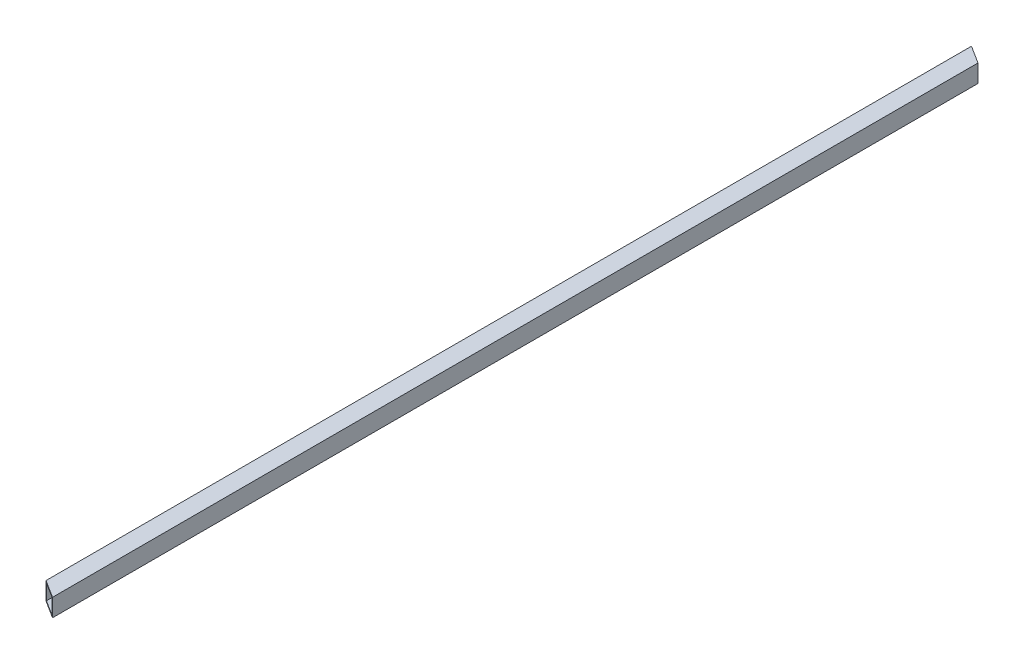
ISO-10303-21;
HEADER;
FILE_DESCRIPTION(('STEP AP214'),'2;1');
FILE_NAME('part.step','',(''),(''),'','','');
FILE_SCHEMA(('AUTOMOTIVE_DESIGN { 1 0 10303 214 1 1 1 1 }'));
ENDSEC;
DATA;
#1=APPLICATION_CONTEXT('core data for automotive mechanical design processes');
#2=APPLICATION_PROTOCOL_DEFINITION('international standard','automotive_design',2000,#1);
#3=PRODUCT_CONTEXT('',#1,'mechanical');
#4=PRODUCT('Part','Part','',(#3));
#5=PRODUCT_RELATED_PRODUCT_CATEGORY('part','',(#4));
#6=PRODUCT_DEFINITION_FORMATION('','',#4);
#7=PRODUCT_DEFINITION_CONTEXT('part definition',#1,'design');
#8=PRODUCT_DEFINITION('design','',#6,#7);
#9=PRODUCT_DEFINITION_SHAPE('','',#8);
#10=(LENGTH_UNIT() NAMED_UNIT(*) SI_UNIT(.MILLI.,.METRE.));
#11=(NAMED_UNIT(*) PLANE_ANGLE_UNIT() SI_UNIT($,.RADIAN.));
#12=(NAMED_UNIT(*) SI_UNIT($,.STERADIAN.) SOLID_ANGLE_UNIT());
#13=UNCERTAINTY_MEASURE_WITH_UNIT(LENGTH_MEASURE(1.E-05),#10,'distance_accuracy_value','');
#14=(GEOMETRIC_REPRESENTATION_CONTEXT(3) GLOBAL_UNCERTAINTY_ASSIGNED_CONTEXT((#13)) GLOBAL_UNIT_ASSIGNED_CONTEXT((#10,
#11,#12)) REPRESENTATION_CONTEXT('',''));
#15=CARTESIAN_POINT('',(0.,0.,0.));
#16=DIRECTION('',(0.,0.,1.));
#17=DIRECTION('',(1.,0.,0.));
#18=AXIS2_PLACEMENT_3D('',#15,#16,#17);
#19=CARTESIAN_POINT('',(0.,0.,2677.0203));
#20=DIRECTION('',(1.,0.,0.));
#21=DIRECTION('',(0.,0.,-1.));
#22=AXIS2_PLACEMENT_3D('',#19,#20,#21);
#23=PLANE('',#22);
#24=DIRECTION('',(0.,0.,-1.));
#25=VECTOR('',#24,1.);
#26=CARTESIAN_POINT('',(0.,0.,2677.0203));
#27=LINE('',#26,#25);
#28=CARTESIAN_POINT('',(0.,0.,2644.91259544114));
#29=VERTEX_POINT('',#28);
#30=CARTESIAN_POINT('',(0.,0.,0.));
#31=VERTEX_POINT('',#30);
#32=EDGE_CURVE('E114',#29,#31,#27,.T.);
#33=ORIENTED_EDGE('',*,*,#32,.F.);
#34=DIRECTION('',(0.,1.,0.));
#35=VECTOR('',#34,1.);
#36=CARTESIAN_POINT('',(0.,0.,2644.91259544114));
#37=LINE('',#36,#35);
#38=CARTESIAN_POINT('',(0.,50.8,2644.91259544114));
#39=VERTEX_POINT('',#38);
#40=EDGE_CURVE('E101',#29,#39,#37,.T.);
#41=ORIENTED_EDGE('',*,*,#40,.T.);
#42=DIRECTION('',(0.,0.,-1.));
#43=VECTOR('',#42,1.);
#44=CARTESIAN_POINT('',(0.,50.8,2677.0203));
#45=LINE('',#44,#43);
#46=CARTESIAN_POINT('',(0.,50.8,0.));
#47=VERTEX_POINT('',#46);
#48=EDGE_CURVE('E120',#39,#47,#45,.T.);
#49=ORIENTED_EDGE('',*,*,#48,.T.);
#50=DIRECTION('',(0.,-1.,0.));
#51=VECTOR('',#50,1.);
#52=CARTESIAN_POINT('',(0.,0.,0.));
#53=LINE('',#52,#51);
#54=EDGE_CURVE('E121',#47,#31,#53,.T.);
#55=ORIENTED_EDGE('',*,*,#54,.T.);
#56=EDGE_LOOP('',(#33,#41,#49,#55));
#57=FACE_BOUND('',#56,.T.);
#58=ADVANCED_FACE('F30',(#57),#23,.F.);
#59=CARTESIAN_POINT('',(0.,0.,2677.0203));
#60=DIRECTION('',(0.,1.,0.));
#61=DIRECTION('',(0.,0.,1.));
#62=AXIS2_PLACEMENT_3D('',#59,#60,#61);
#63=PLANE('',#62);
#64=DIRECTION('',(0.,0.,-1.));
#65=VECTOR('',#64,1.);
#66=CARTESIAN_POINT('',(50.8,0.,2677.0203));
#67=LINE('',#66,#65);
#68=CARTESIAN_POINT('',(50.8,0.,2677.0203));
#69=VERTEX_POINT('',#68);
#70=CARTESIAN_POINT('',(50.8000000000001,0.,32.1077045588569));
#71=VERTEX_POINT('',#70);
#72=EDGE_CURVE('E108',#69,#71,#67,.T.);
#73=ORIENTED_EDGE('',*,*,#72,.F.);
#74=DIRECTION('',(0.845312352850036,0.,0.534272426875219));
#75=VECTOR('',#74,1.);
#76=CARTESIAN_POINT('',(50.8,0.,2677.0203));
#77=LINE('',#76,#75);
#78=EDGE_CURVE('E94',#29,#69,#77,.T.);
#79=ORIENTED_EDGE('',*,*,#78,.F.);
#80=ORIENTED_EDGE('',*,*,#32,.T.);
#81=DIRECTION('',(-0.845312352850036,0.,-0.534272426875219));
#82=VECTOR('',#81,1.);
#83=CARTESIAN_POINT('',(0.,0.,0.));
#84=LINE('',#83,#82);
#85=EDGE_CURVE('E111',#71,#31,#84,.T.);
#86=ORIENTED_EDGE('',*,*,#85,.F.);
#87=EDGE_LOOP('',(#73,#79,#80,#86));
#88=FACE_BOUND('',#87,.T.);
#89=ADVANCED_FACE('F109',(#88),#63,.F.);
#90=CARTESIAN_POINT('',(50.8,0.,2677.0203));
#91=DIRECTION('',(-1.,0.,0.));
#92=DIRECTION('',(0.,-1.,0.));
#93=AXIS2_PLACEMENT_3D('',#90,#91,#92);
#94=PLANE('',#93);
#95=ORIENTED_EDGE('',*,*,#72,.T.);
#96=DIRECTION('',(0.,1.,0.));
#97=VECTOR('',#96,1.);
#98=CARTESIAN_POINT('',(50.8,-9.13362962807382E-13,32.1077045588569));
#99=LINE('',#98,#97);
#100=CARTESIAN_POINT('',(50.7999999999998,50.8,32.1077045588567));
#101=VERTEX_POINT('',#100);
#102=EDGE_CURVE('E148',#71,#101,#99,.T.);
#103=ORIENTED_EDGE('',*,*,#102,.T.);
#104=DIRECTION('',(0.,0.,-1.));
#105=VECTOR('',#104,1.);
#106=CARTESIAN_POINT('',(50.8,50.8,2677.0203));
#107=LINE('',#106,#105);
#108=CARTESIAN_POINT('',(50.8,50.8,2677.0203));
#109=VERTEX_POINT('',#108);
#110=EDGE_CURVE('E115',#109,#101,#107,.T.);
#111=ORIENTED_EDGE('',*,*,#110,.F.);
#112=DIRECTION('',(0.,1.,0.));
#113=VECTOR('',#112,1.);
#114=CARTESIAN_POINT('',(50.8,0.,2677.0203));
#115=LINE('',#114,#113);
#116=EDGE_CURVE('E98',#69,#109,#115,.T.);
#117=ORIENTED_EDGE('',*,*,#116,.F.);
#118=EDGE_LOOP('',(#95,#103,#111,#117));
#119=FACE_BOUND('',#118,.T.);
#120=ADVANCED_FACE('F118',(#119),#94,.F.);
#121=CARTESIAN_POINT('',(0.,50.8,2677.0203));
#122=DIRECTION('',(0.,-1.,0.));
#123=DIRECTION('',(0.,0.,-1.));
#124=AXIS2_PLACEMENT_3D('',#121,#122,#123);
#125=PLANE('',#124);
#126=ORIENTED_EDGE('',*,*,#48,.F.);
#127=DIRECTION('',(0.845312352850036,0.,0.534272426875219));
#128=VECTOR('',#127,1.);
#129=CARTESIAN_POINT('',(50.8,50.8,2677.0203));
#130=LINE('',#129,#128);
#131=EDGE_CURVE('E104',#39,#109,#130,.T.);
#132=ORIENTED_EDGE('',*,*,#131,.T.);
#133=ORIENTED_EDGE('',*,*,#110,.T.);
#134=DIRECTION('',(-0.845312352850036,0.,-0.534272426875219));
#135=VECTOR('',#134,1.);
#136=CARTESIAN_POINT('',(0.,50.8,0.));
#137=LINE('',#136,#135);
#138=EDGE_CURVE('E163',#101,#47,#137,.T.);
#139=ORIENTED_EDGE('',*,*,#138,.T.);
#140=EDGE_LOOP('',(#126,#132,#133,#139));
#141=FACE_BOUND('',#140,.T.);
#142=ADVANCED_FACE('F175',(#141),#125,.F.);
#143=CARTESIAN_POINT('',(3.175,3.175,2677.0203));
#144=DIRECTION('',(1.,0.,0.));
#145=DIRECTION('',(0.,0.,-1.));
#146=AXIS2_PLACEMENT_3D('',#143,#144,#145);
#147=PLANE('',#146);
#148=DIRECTION('',(0.,1.,0.));
#149=VECTOR('',#148,1.);
#150=CARTESIAN_POINT('',(3.175,3.175,2646.91932697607));
#151=LINE('',#150,#149);
#152=CARTESIAN_POINT('',(3.175,3.175,2646.91932697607));
#153=VERTEX_POINT('',#152);
#154=CARTESIAN_POINT('',(3.17500000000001,47.625,2646.91932697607));
#155=VERTEX_POINT('',#154);
#156=EDGE_CURVE('E43',#153,#155,#151,.T.);
#157=ORIENTED_EDGE('',*,*,#156,.F.);
#158=DIRECTION('',(0.,0.,-1.));
#159=VECTOR('',#158,1.);
#160=CARTESIAN_POINT('',(3.175,3.175,2677.0203));
#161=LINE('',#160,#159);
#162=CARTESIAN_POINT('',(3.17499999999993,3.175,2.00673153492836));
#163=VERTEX_POINT('',#162);
#164=EDGE_CURVE('E125',#153,#163,#161,.T.);
#165=ORIENTED_EDGE('',*,*,#164,.T.);
#166=DIRECTION('',(0.,-1.,0.));
#167=VECTOR('',#166,1.);
#168=CARTESIAN_POINT('',(3.175,3.175,2.00673153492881));
#169=LINE('',#168,#167);
#170=CARTESIAN_POINT('',(3.17499999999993,47.625,2.00673153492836));
#171=VERTEX_POINT('',#170);
#172=EDGE_CURVE('E139',#171,#163,#169,.T.);
#173=ORIENTED_EDGE('',*,*,#172,.F.);
#174=DIRECTION('',(0.,0.,-1.));
#175=VECTOR('',#174,1.);
#176=CARTESIAN_POINT('',(3.175,47.625,2677.0203));
#177=LINE('',#176,#175);
#178=EDGE_CURVE('E146',#155,#171,#177,.T.);
#179=ORIENTED_EDGE('',*,*,#178,.F.);
#180=EDGE_LOOP('',(#157,#165,#173,#179));
#181=FACE_BOUND('',#180,.T.);
#182=ADVANCED_FACE('F145',(#181),#147,.T.);
#183=CARTESIAN_POINT('',(3.175,3.175,2677.0203));
#184=DIRECTION('',(0.,1.,0.));
#185=DIRECTION('',(0.,0.,1.));
#186=AXIS2_PLACEMENT_3D('',#183,#184,#185);
#187=PLANE('',#186);
#188=DIRECTION('',(-0.845312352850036,0.,-0.534272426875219));
#189=VECTOR('',#188,1.);
#190=CARTESIAN_POINT('',(16.7694146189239,3.175,2655.51156020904));
#191=LINE('',#190,#189);
#192=CARTESIAN_POINT('',(47.625,3.175,2675.01356846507));
#193=VERTEX_POINT('',#192);
#194=EDGE_CURVE('E161',#193,#153,#191,.T.);
#195=ORIENTED_EDGE('',*,*,#194,.F.);
#196=DIRECTION('',(0.,0.,-1.));
#197=VECTOR('',#196,1.);
#198=CARTESIAN_POINT('',(47.625,3.175,2677.0203));
#199=LINE('',#198,#197);
#200=CARTESIAN_POINT('',(47.625,3.175,30.1009730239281));
#201=VERTEX_POINT('',#200);
#202=EDGE_CURVE('E156',#193,#201,#199,.T.);
#203=ORIENTED_EDGE('',*,*,#202,.T.);
#204=DIRECTION('',(0.845312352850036,0.,0.534272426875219));
#205=VECTOR('',#204,1.);
#206=CARTESIAN_POINT('',(1211.2835728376,3.175,765.581399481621));
#207=LINE('',#206,#205);
#208=EDGE_CURVE('E149',#163,#201,#207,.T.);
#209=ORIENTED_EDGE('',*,*,#208,.F.);
#210=ORIENTED_EDGE('',*,*,#164,.F.);
#211=EDGE_LOOP('',(#195,#203,#209,#210));
#212=FACE_BOUND('',#211,.T.);
#213=ADVANCED_FACE('F160',(#212),#187,.T.);
#214=CARTESIAN_POINT('',(47.625,3.175,2677.0203));
#215=DIRECTION('',(-1.,0.,0.));
#216=DIRECTION('',(0.,-1.,0.));
#217=AXIS2_PLACEMENT_3D('',#214,#215,#216);
#218=PLANE('',#217);
#219=DIRECTION('',(0.,-1.,0.));
#220=VECTOR('',#219,1.);
#221=CARTESIAN_POINT('',(47.625,3.175,2675.01356846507));
#222=LINE('',#221,#220);
#223=CARTESIAN_POINT('',(47.625,47.625,2675.01356846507));
#224=VERTEX_POINT('',#223);
#225=EDGE_CURVE('E171',#224,#193,#222,.T.);
#226=ORIENTED_EDGE('',*,*,#225,.F.);
#227=DIRECTION('',(0.,0.,-1.));
#228=VECTOR('',#227,1.);
#229=CARTESIAN_POINT('',(47.625,47.625,2677.0203));
#230=LINE('',#229,#228);
#231=CARTESIAN_POINT('',(47.625,47.625,30.1009730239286));
#232=VERTEX_POINT('',#231);
#233=EDGE_CURVE('E51',#224,#232,#230,.T.);
#234=ORIENTED_EDGE('',*,*,#233,.T.);
#235=DIRECTION('',(0.,1.,0.));
#236=VECTOR('',#235,1.);
#237=CARTESIAN_POINT('',(47.625,3.17499999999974,30.1009730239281));
#238=LINE('',#237,#236);
#239=EDGE_CURVE('E141',#201,#232,#238,.T.);
#240=ORIENTED_EDGE('',*,*,#239,.F.);
#241=ORIENTED_EDGE('',*,*,#202,.F.);
#242=EDGE_LOOP('',(#226,#234,#240,#241));
#243=FACE_BOUND('',#242,.T.);
#244=ADVANCED_FACE('F162',(#243),#218,.T.);
#245=CARTESIAN_POINT('',(3.175,47.625,2677.0203));
#246=DIRECTION('',(0.,-1.,0.));
#247=DIRECTION('',(0.,0.,-1.));
#248=AXIS2_PLACEMENT_3D('',#245,#246,#247);
#249=PLANE('',#248);
#250=DIRECTION('',(0.845312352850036,0.,0.534272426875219));
#251=VECTOR('',#250,1.);
#252=CARTESIAN_POINT('',(16.7694146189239,47.625,2655.51156020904));
#253=LINE('',#252,#251);
#254=EDGE_CURVE('E11',#155,#224,#253,.T.);
#255=ORIENTED_EDGE('',*,*,#254,.F.);
#256=ORIENTED_EDGE('',*,*,#178,.T.);
#257=DIRECTION('',(-0.845312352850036,0.,-0.534272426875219));
#258=VECTOR('',#257,1.);
#259=CARTESIAN_POINT('',(1211.2835728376,47.625,765.581399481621));
#260=LINE('',#259,#258);
#261=EDGE_CURVE('E37',#232,#171,#260,.T.);
#262=ORIENTED_EDGE('',*,*,#261,.F.);
#263=ORIENTED_EDGE('',*,*,#233,.F.);
#264=EDGE_LOOP('',(#255,#256,#262,#263));
#265=FACE_BOUND('',#264,.T.);
#266=ADVANCED_FACE('F179',(#265),#249,.T.);
#267=CARTESIAN_POINT('',(0.,50.8,0.));
#268=DIRECTION('',(-0.534272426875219,0.,0.845312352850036));
#269=DIRECTION('',(0.845312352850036,0.,0.534272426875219));
#270=AXIS2_PLACEMENT_3D('',#267,#268,#269);
#271=PLANE('',#270);
#272=ORIENTED_EDGE('',*,*,#172,.T.);
#273=ORIENTED_EDGE('',*,*,#208,.T.);
#274=ORIENTED_EDGE('',*,*,#239,.T.);
#275=ORIENTED_EDGE('',*,*,#261,.T.);
#276=EDGE_LOOP('',(#272,#273,#274,#275));
#277=FACE_BOUND('',#276,.T.);
#278=ORIENTED_EDGE('',*,*,#85,.T.);
#279=ORIENTED_EDGE('',*,*,#54,.F.);
#280=ORIENTED_EDGE('',*,*,#138,.F.);
#281=ORIENTED_EDGE('',*,*,#102,.F.);
#282=EDGE_LOOP('',(#278,#279,#280,#281));
#283=FACE_BOUND('',#282,.T.);
#284=ADVANCED_FACE('F136',(#277,#283),#271,.F.);
#285=CARTESIAN_POINT('',(50.8,50.8,2677.0203));
#286=DIRECTION('',(0.534272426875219,0.,-0.845312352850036));
#287=DIRECTION('',(-0.845312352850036,0.,-0.534272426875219));
#288=AXIS2_PLACEMENT_3D('',#285,#286,#287);
#289=PLANE('',#288);
#290=ORIENTED_EDGE('',*,*,#156,.T.);
#291=ORIENTED_EDGE('',*,*,#254,.T.);
#292=ORIENTED_EDGE('',*,*,#225,.T.);
#293=ORIENTED_EDGE('',*,*,#194,.T.);
#294=EDGE_LOOP('',(#290,#291,#292,#293));
#295=FACE_BOUND('',#294,.T.);
#296=ORIENTED_EDGE('',*,*,#78,.T.);
#297=ORIENTED_EDGE('',*,*,#116,.T.);
#298=ORIENTED_EDGE('',*,*,#131,.F.);
#299=ORIENTED_EDGE('',*,*,#40,.F.);
#300=EDGE_LOOP('',(#296,#297,#298,#299));
#301=FACE_BOUND('',#300,.T.);
#302=ADVANCED_FACE('F96',(#295,#301),#289,.F.);
#303=CLOSED_SHELL('',(#58,#89,#120,#142,#182,#213,#244,#266,#284,#302));
#304=MANIFOLD_SOLID_BREP('B2',#303);
#305=ADVANCED_BREP_SHAPE_REPRESENTATION('',(#18,#304),#14);
#306=SHAPE_DEFINITION_REPRESENTATION(#9,#305);
ENDSEC;
END-ISO-10303-21;
